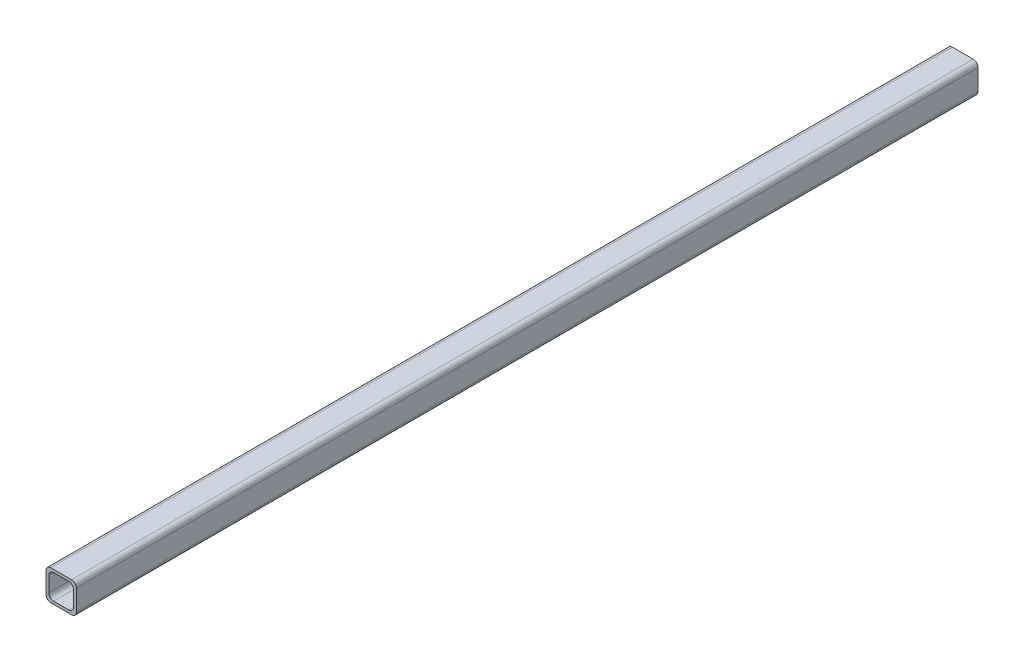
from build123d import *

# Parameters (mm, degrees)
BASE_EXTRUSION_DEPTH = 475


with BuildPart() as part:
    # Esquisse1 → Base-Extrusion (new body)
    with BuildSketch(Plane.XY):
        with BuildLine():
            Line((-5.5, 8), (5.5, 8))
            ThreePointArc((5.5, 8), (7.267766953, 7.267766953), (8, 5.5))
            Line((8, 5.5), (8, -5.5))
            ThreePointArc((8, -5.5), (7.267766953, -7.267766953), (5.5, -8))
            Line((5.5, -8), (-5.5, -8))
            ThreePointArc((-5.5, -8), (-7.267766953, -7.267766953), (-8, -5.5))
            Line((-8, -5.5), (-8, 5.5))
            ThreePointArc((-8, 5.5), (-7.267766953, 7.267766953), (-5.5, 8))
        make_face()
        with BuildLine():
            Line((-4, 6.5), (4, 6.5))
            ThreePointArc((4, 6.5), (5.767766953, 5.767766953), (6.5, 4))
            Line((6.5, 4), (6.5, -4))
            ThreePointArc((6.5, -4), (5.767766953, -5.767766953), (4, -6.5))
            Line((4, -6.5), (-4, -6.5))
            ThreePointArc((-4, -6.5), (-5.767766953, -5.767766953), (-6.5, -4))
            Line((-6.5, -4), (-6.5, 4))
            ThreePointArc((-6.5, 4), (-5.767766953, 5.767766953), (-4, 6.5))
        make_face(mode=Mode.SUBTRACT)
    extrude(amount=BASE_EXTRUSION_DEPTH)


solid = part.part
